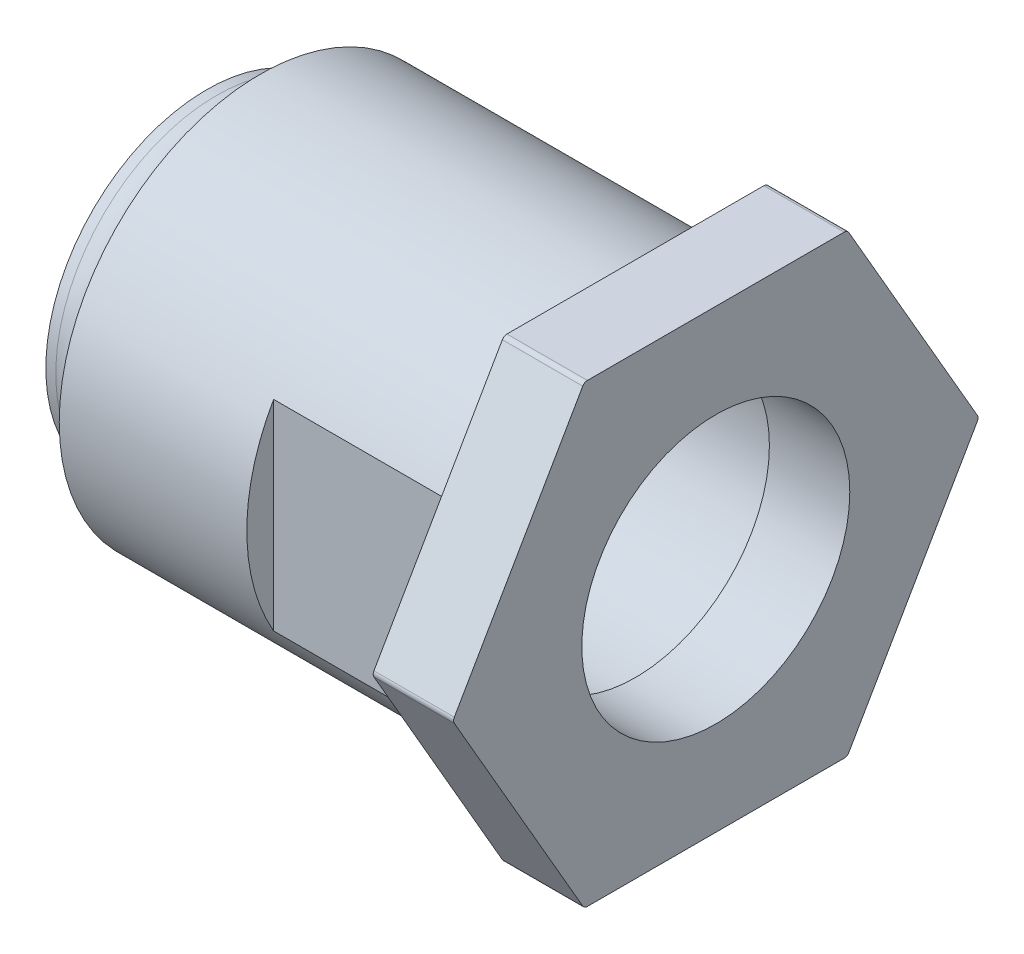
from build123d import *

# Parameters (mm, degrees)
SKETCH3_OUTSIDE_W   = 22.314
SKETCH3_OUTSIDE_H   = 22.314
SKETCH3_OUTSIDE_W_2 = 13
SKETCH3_OUTSIDE_H_2 = 17
CUT_EXTRUDE1_DEPTH  = 7
SKETCH4_R           = 5
BOSS_EXTRUDE1_DEPTH = 3
FILLET1_R           = 0.2


with BuildPart() as part:
    # Sketch1 → Revolve1 (revolve)
    with BuildSketch(Plane.XY, mode=Mode.PRIVATE) as revolve1_sk:
        with BuildLine():
            Line((0, 7.5), (0, 5.5))
            Line((0, 5.5), (-16, 5.5))
            Line((-16, 5.5), (-16, 6))
            Line((-16, 6), (-15.629503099, 6))
            ThreePointArc((-15.629503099, 6), (-14.485761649, 6.392606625), (-14, 7.5))
            Line((-14, 7.5), (0, 7.5))
        make_face()
    revolve(revolve1_sk.sketch.rotate(Axis((0, 0, 0), (-1, 0, 0)), 90), axis=Axis((0, 0, 0), (-1, 0, 0)))

    # Sketch3 outside → Cut-Extrude1 (cut)
    with BuildSketch(Plane(origin=(0, 0, 0), x_dir=(0, 0, -1), z_dir=(1, 0, 0))):
        Rectangle(SKETCH3_OUTSIDE_W, SKETCH3_OUTSIDE_H)
        Rectangle(SKETCH3_OUTSIDE_W_2, SKETCH3_OUTSIDE_H_2, mode=Mode.SUBTRACT)
    extrude(amount=-CUT_EXTRUDE1_DEPTH, mode=Mode.SUBTRACT)

    # Sketch4 → Boss-Extrude1 (add)
    with BuildSketch(Plane(origin=(0, 0, 0), x_dir=(0, 0, -1), z_dir=(1, 0, 0))):
        Polygon((4.907477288, 8.5), (-4.907477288, 8.5), (-9.814954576, 0), (-4.907477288, -8.5), (4.907477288, -8.5), (9.814954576, 0), align=None)
        Circle(SKETCH4_R, mode=Mode.SUBTRACT)
    extrude(amount=BOSS_EXTRUDE1_DEPTH)

    # Fillet1
    fillet1_edges = [part.edges().sort_by_distance(p)[0] for p in [
        (1.5, 0, -9.814954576),
        (1.5, 8.5, -4.907477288),
        (1.5, 8.5, 4.907477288),
        (1.5, 0, 9.814954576),
        (1.5, -8.5, 4.907477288),
        (1.5, -8.5, -4.907477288),
    ]]
    fillet(fillet1_edges, radius=FILLET1_R)


solid = part.part
